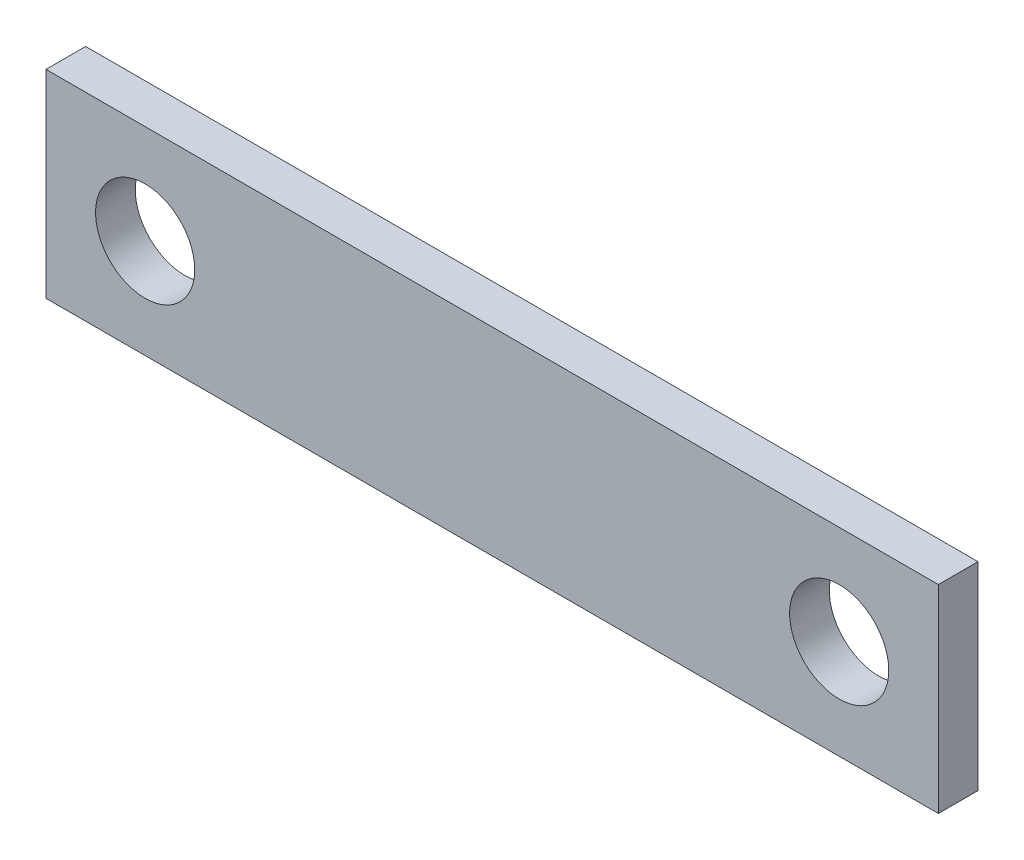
from build123d import *

# Parameters (mm, degrees)
ESQUISSE1_W      = 180
ESQUISSE1_H      = 40
ESQUISSE1_R      = 10
EXTRUSION1_DEPTH = 8


with BuildPart() as part:
    # Esquisse1 → Extrusion1 (new body)
    with BuildSketch(Plane.XY):
        with Locations((90, 20)):
            Rectangle(ESQUISSE1_W, ESQUISSE1_H)
        with Locations((20, 20)):
            Circle(ESQUISSE1_R, mode=Mode.SUBTRACT)
        with Locations((160, 20)):
            Circle(ESQUISSE1_R, mode=Mode.SUBTRACT)
    extrude(amount=EXTRUSION1_DEPTH)


solid = part.part
